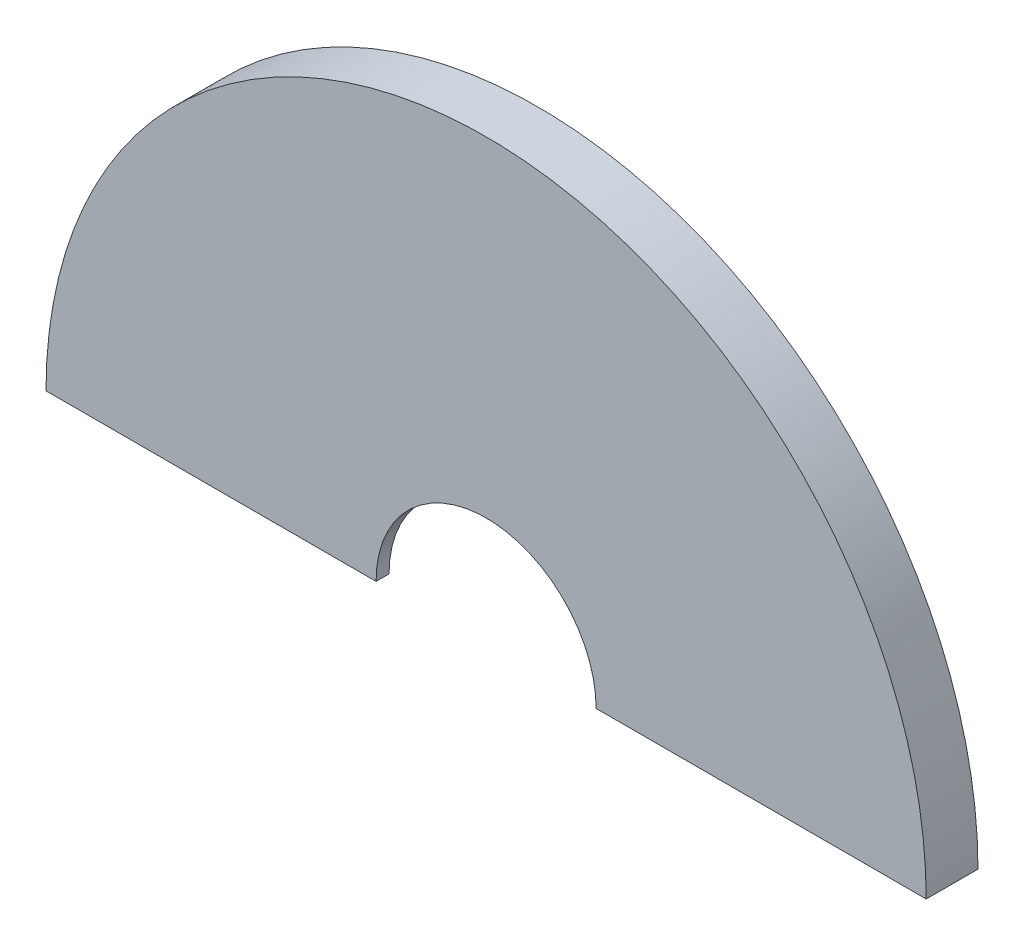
ISO-10303-21;
HEADER;
FILE_DESCRIPTION(('STEP AP214'),'2;1');
FILE_NAME('part.step','',(''),(''),'','','');
FILE_SCHEMA(('AUTOMOTIVE_DESIGN { 1 0 10303 214 1 1 1 1 }'));
ENDSEC;
DATA;
#1=APPLICATION_CONTEXT('core data for automotive mechanical design processes');
#2=APPLICATION_PROTOCOL_DEFINITION('international standard','automotive_design',2000,#1);
#3=PRODUCT_CONTEXT('',#1,'mechanical');
#4=PRODUCT('Part','Part','',(#3));
#5=PRODUCT_RELATED_PRODUCT_CATEGORY('part','',(#4));
#6=PRODUCT_DEFINITION_FORMATION('','',#4);
#7=PRODUCT_DEFINITION_CONTEXT('part definition',#1,'design');
#8=PRODUCT_DEFINITION('design','',#6,#7);
#9=PRODUCT_DEFINITION_SHAPE('','',#8);
#10=(LENGTH_UNIT() NAMED_UNIT(*) SI_UNIT(.MILLI.,.METRE.));
#11=(NAMED_UNIT(*) PLANE_ANGLE_UNIT() SI_UNIT($,.RADIAN.));
#12=(NAMED_UNIT(*) SI_UNIT($,.STERADIAN.) SOLID_ANGLE_UNIT());
#13=UNCERTAINTY_MEASURE_WITH_UNIT(LENGTH_MEASURE(1.E-05),#10,'distance_accuracy_value','');
#14=(GEOMETRIC_REPRESENTATION_CONTEXT(3) GLOBAL_UNCERTAINTY_ASSIGNED_CONTEXT((#13)) GLOBAL_UNIT_ASSIGNED_CONTEXT((#10,
#11,#12)) REPRESENTATION_CONTEXT('',''));
#15=CARTESIAN_POINT('',(0.,0.,0.));
#16=DIRECTION('',(0.,0.,1.));
#17=DIRECTION('',(1.,0.,0.));
#18=AXIS2_PLACEMENT_3D('',#15,#16,#17);
#19=CARTESIAN_POINT('',(0.,0.,-6.5));
#20=DIRECTION('',(0.,0.,1.));
#21=DIRECTION('',(1.,0.,0.));
#22=AXIS2_PLACEMENT_3D('',#19,#20,#21);
#23=CYLINDRICAL_SURFACE('',#22,15.5);
#24=CARTESIAN_POINT('',(0.,0.,-3.));
#25=DIRECTION('',(0.,0.,-1.));
#26=DIRECTION('',(-1.,0.,0.));
#27=AXIS2_PLACEMENT_3D('',#24,#25,#26);
#28=CIRCLE('',#27,15.5);
#29=CARTESIAN_POINT('',(15.5,0.,-3.));
#30=VERTEX_POINT('',#29);
#31=CARTESIAN_POINT('',(15.4883827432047,0.600000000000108,-3.));
#32=VERTEX_POINT('',#31);
#33=EDGE_CURVE('E356',#30,#32,#28,.F.);
#34=ORIENTED_EDGE('',*,*,#33,.F.);
#35=DIRECTION('',(0.,0.,1.));
#36=VECTOR('',#35,1.);
#37=CARTESIAN_POINT('',(15.5,0.,-6.5));
#38=LINE('',#37,#36);
#39=CARTESIAN_POINT('',(15.5,0.,-6.));
#40=VERTEX_POINT('',#39);
#41=EDGE_CURVE('E714',#30,#40,#38,.F.);
#42=ORIENTED_EDGE('',*,*,#41,.T.);
#43=CARTESIAN_POINT('',(0.,0.,-6.));
#44=DIRECTION('',(0.,0.,1.));
#45=DIRECTION('',(1.,0.,0.));
#46=AXIS2_PLACEMENT_3D('',#43,#44,#45);
#47=CIRCLE('',#46,15.5);
#48=CARTESIAN_POINT('',(-15.5,0.,-6.));
#49=VERTEX_POINT('',#48);
#50=EDGE_CURVE('E286',#40,#49,#47,.T.);
#51=ORIENTED_EDGE('',*,*,#50,.T.);
#52=DIRECTION('',(0.,0.,1.));
#53=VECTOR('',#52,1.);
#54=CARTESIAN_POINT('',(-15.5,0.,-6.5));
#55=LINE('',#54,#53);
#56=CARTESIAN_POINT('',(-15.5,0.,-3.));
#57=VERTEX_POINT('',#56);
#58=EDGE_CURVE('E48',#49,#57,#55,.T.);
#59=ORIENTED_EDGE('',*,*,#58,.T.);
#60=CARTESIAN_POINT('',(0.,0.,-3.));
#61=DIRECTION('',(0.,0.,-1.));
#62=DIRECTION('',(-1.,0.,0.));
#63=AXIS2_PLACEMENT_3D('',#60,#61,#62);
#64=CIRCLE('',#63,15.5);
#65=CARTESIAN_POINT('',(-15.4883827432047,0.6,-3.));
#66=VERTEX_POINT('',#65);
#67=EDGE_CURVE('E339',#66,#57,#64,.F.);
#68=ORIENTED_EDGE('',*,*,#67,.F.);
#69=DIRECTION('',(0.,0.,1.));
#70=VECTOR('',#69,1.);
#71=CARTESIAN_POINT('',(-15.4883827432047,0.6,-6.5));
#72=LINE('',#71,#70);
#73=CARTESIAN_POINT('',(-15.4883827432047,0.6,-1.));
#74=VERTEX_POINT('',#73);
#75=EDGE_CURVE('E336',#66,#74,#72,.T.);
#76=ORIENTED_EDGE('',*,*,#75,.T.);
#77=CARTESIAN_POINT('',(0.,0.,-1.));
#78=DIRECTION('',(0.,0.,1.));
#79=DIRECTION('',(1.,0.,0.));
#80=AXIS2_PLACEMENT_3D('',#77,#78,#79);
#81=CIRCLE('',#80,15.5);
#82=CARTESIAN_POINT('',(-13.7133329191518,7.22457612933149,-1.));
#83=VERTEX_POINT('',#82);
#84=EDGE_CURVE('E319',#83,#74,#81,.T.);
#85=ORIENTED_EDGE('',*,*,#84,.F.);
#86=DIRECTION('',(0.,0.,1.));
#87=VECTOR('',#86,1.);
#88=CARTESIAN_POINT('',(-13.7133329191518,7.22457612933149,-6.5));
#89=LINE('',#88,#87);
#90=CARTESIAN_POINT('',(-13.7133329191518,7.22457612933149,-3.));
#91=VERTEX_POINT('',#90);
#92=EDGE_CURVE('E477',#83,#91,#89,.F.);
#93=ORIENTED_EDGE('',*,*,#92,.T.);
#94=CARTESIAN_POINT('',(0.,0.,-3.));
#95=DIRECTION('',(0.,0.,-1.));
#96=DIRECTION('',(-1.,0.,0.));
#97=AXIS2_PLACEMENT_3D('',#94,#95,#96);
#98=CIRCLE('',#97,15.5);
#99=CARTESIAN_POINT('',(-13.1133329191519,8.26380661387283,-3.));
#100=VERTEX_POINT('',#99);
#101=EDGE_CURVE('E481',#100,#91,#98,.F.);
#102=ORIENTED_EDGE('',*,*,#101,.F.);
#103=DIRECTION('',(0.,0.,1.));
#104=VECTOR('',#103,1.);
#105=CARTESIAN_POINT('',(-13.1133329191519,8.26380661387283,-6.5));
#106=LINE('',#105,#104);
#107=CARTESIAN_POINT('',(-13.1133329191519,8.26380661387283,-1.));
#108=VERTEX_POINT('',#107);
#109=EDGE_CURVE('E479',#100,#108,#106,.T.);
#110=ORIENTED_EDGE('',*,*,#109,.T.);
#111=CARTESIAN_POINT('',(-8.26380661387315,13.1133329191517,-1.));
#112=VERTEX_POINT('',#111);
#113=EDGE_CURVE('E321',#112,#108,#81,.T.);
#114=ORIENTED_EDGE('',*,*,#113,.F.);
#115=DIRECTION('',(0.,0.,1.));
#116=VECTOR('',#115,1.);
#117=CARTESIAN_POINT('',(-8.26380661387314,13.1133329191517,-6.5));
#118=LINE('',#117,#116);
#119=CARTESIAN_POINT('',(-8.26380661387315,13.1133329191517,-3.));
#120=VERTEX_POINT('',#119);
#121=EDGE_CURVE('E449',#112,#120,#118,.F.);
#122=ORIENTED_EDGE('',*,*,#121,.T.);
#123=CARTESIAN_POINT('',(0.,0.,-3.));
#124=DIRECTION('',(0.,0.,-1.));
#125=DIRECTION('',(-1.,0.,0.));
#126=AXIS2_PLACEMENT_3D('',#123,#124,#125);
#127=CIRCLE('',#126,15.5);
#128=CARTESIAN_POINT('',(-7.22457612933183,13.7133329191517,-3.));
#129=VERTEX_POINT('',#128);
#130=EDGE_CURVE('E453',#129,#120,#127,.F.);
#131=ORIENTED_EDGE('',*,*,#130,.F.);
#132=DIRECTION('',(0.,0.,1.));
#133=VECTOR('',#132,1.);
#134=CARTESIAN_POINT('',(-7.22457612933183,13.7133329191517,-6.5));
#135=LINE('',#134,#133);
#136=CARTESIAN_POINT('',(-7.22457612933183,13.7133329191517,-1.));
#137=VERTEX_POINT('',#136);
#138=EDGE_CURVE('E451',#129,#137,#135,.T.);
#139=ORIENTED_EDGE('',*,*,#138,.T.);
#140=CARTESIAN_POINT('',(-0.600000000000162,15.4883827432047,-1.));
#141=VERTEX_POINT('',#140);
#142=EDGE_CURVE('E668',#141,#137,#81,.T.);
#143=ORIENTED_EDGE('',*,*,#142,.F.);
#144=DIRECTION('',(0.,0.,1.));
#145=VECTOR('',#144,1.);
#146=CARTESIAN_POINT('',(-0.600000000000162,15.4883827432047,-6.5));
#147=LINE('',#146,#145);
#148=CARTESIAN_POINT('',(-0.600000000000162,15.4883827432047,-3.));
#149=VERTEX_POINT('',#148);
#150=EDGE_CURVE('E423',#141,#149,#147,.F.);
#151=ORIENTED_EDGE('',*,*,#150,.T.);
#152=CARTESIAN_POINT('',(0.,0.,-3.));
#153=DIRECTION('',(0.,0.,-1.));
#154=DIRECTION('',(-1.,0.,0.));
#155=AXIS2_PLACEMENT_3D('',#152,#153,#154);
#156=CIRCLE('',#155,15.5);
#157=CARTESIAN_POINT('',(0.599999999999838,15.4883827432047,-3.));
#158=VERTEX_POINT('',#157);
#159=EDGE_CURVE('E428',#158,#149,#156,.F.);
#160=ORIENTED_EDGE('',*,*,#159,.F.);
#161=DIRECTION('',(0.,0.,1.));
#162=VECTOR('',#161,1.);
#163=CARTESIAN_POINT('',(0.599999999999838,15.4883827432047,-6.5));
#164=LINE('',#163,#162);
#165=CARTESIAN_POINT('',(0.599999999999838,15.4883827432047,-1.5));
#166=VERTEX_POINT('',#165);
#167=EDGE_CURVE('E425',#158,#166,#164,.T.);
#168=ORIENTED_EDGE('',*,*,#167,.T.);
#169=CARTESIAN_POINT('',(0.,0.,-1.5));
#170=DIRECTION('',(0.,0.,1.));
#171=DIRECTION('',(1.,0.,0.));
#172=AXIS2_PLACEMENT_3D('',#169,#170,#171);
#173=CIRCLE('',#172,15.5);
#174=CARTESIAN_POINT('',(7.22457612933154,13.7133329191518,-1.5));
#175=VERTEX_POINT('',#174);
#176=EDGE_CURVE('E296',#166,#175,#173,.F.);
#177=ORIENTED_EDGE('',*,*,#176,.T.);
#178=DIRECTION('',(0.,0.,1.));
#179=VECTOR('',#178,1.);
#180=CARTESIAN_POINT('',(7.22457612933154,13.7133329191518,-6.5));
#181=LINE('',#180,#179);
#182=CARTESIAN_POINT('',(7.22457612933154,13.7133329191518,-3.));
#183=VERTEX_POINT('',#182);
#184=EDGE_CURVE('E398',#175,#183,#181,.F.);
#185=ORIENTED_EDGE('',*,*,#184,.T.);
#186=CARTESIAN_POINT('',(0.,0.,-3.));
#187=DIRECTION('',(0.,0.,-1.));
#188=DIRECTION('',(-1.,0.,0.));
#189=AXIS2_PLACEMENT_3D('',#186,#187,#188);
#190=CIRCLE('',#189,15.5);
#191=CARTESIAN_POINT('',(8.26380661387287,13.1133329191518,-3.));
#192=VERTEX_POINT('',#191);
#193=EDGE_CURVE('E402',#192,#183,#190,.F.);
#194=ORIENTED_EDGE('',*,*,#193,.F.);
#195=DIRECTION('',(0.,0.,1.));
#196=VECTOR('',#195,1.);
#197=CARTESIAN_POINT('',(8.26380661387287,13.1133329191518,-6.5));
#198=LINE('',#197,#196);
#199=CARTESIAN_POINT('',(8.26380661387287,13.1133329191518,-1.));
#200=VERTEX_POINT('',#199);
#201=EDGE_CURVE('E400',#192,#200,#198,.T.);
#202=ORIENTED_EDGE('',*,*,#201,.T.);
#203=CARTESIAN_POINT('',(13.1133329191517,8.2638066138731,-1.));
#204=VERTEX_POINT('',#203);
#205=EDGE_CURVE('E665',#204,#200,#81,.T.);
#206=ORIENTED_EDGE('',*,*,#205,.F.);
#207=DIRECTION('',(0.,0.,1.));
#208=VECTOR('',#207,1.);
#209=CARTESIAN_POINT('',(13.1133329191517,8.2638066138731,-6.5));
#210=LINE('',#209,#208);
#211=CARTESIAN_POINT('',(13.1133329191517,8.2638066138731,-3.));
#212=VERTEX_POINT('',#211);
#213=EDGE_CURVE('E370',#204,#212,#210,.F.);
#214=ORIENTED_EDGE('',*,*,#213,.T.);
#215=CARTESIAN_POINT('',(0.,0.,-3.));
#216=DIRECTION('',(0.,0.,-1.));
#217=DIRECTION('',(-1.,0.,0.));
#218=AXIS2_PLACEMENT_3D('',#215,#216,#217);
#219=CIRCLE('',#218,15.5);
#220=CARTESIAN_POINT('',(13.7133329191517,7.22457612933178,-3.));
#221=VERTEX_POINT('',#220);
#222=EDGE_CURVE('E374',#221,#212,#219,.F.);
#223=ORIENTED_EDGE('',*,*,#222,.F.);
#224=DIRECTION('',(0.,0.,1.));
#225=VECTOR('',#224,1.);
#226=CARTESIAN_POINT('',(13.7133329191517,7.22457612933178,-6.5));
#227=LINE('',#226,#225);
#228=CARTESIAN_POINT('',(13.7133329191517,7.22457612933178,-1.));
#229=VERTEX_POINT('',#228);
#230=EDGE_CURVE('E372',#221,#229,#227,.T.);
#231=ORIENTED_EDGE('',*,*,#230,.T.);
#232=CARTESIAN_POINT('',(15.4883827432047,0.600000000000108,-1.));
#233=VERTEX_POINT('',#232);
#234=EDGE_CURVE('E318',#233,#229,#81,.T.);
#235=ORIENTED_EDGE('',*,*,#234,.F.);
#236=DIRECTION('',(0.,0.,1.));
#237=VECTOR('',#236,1.);
#238=CARTESIAN_POINT('',(15.4883827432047,0.600000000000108,-6.5));
#239=LINE('',#238,#237);
#240=EDGE_CURVE('E353',#233,#32,#239,.F.);
#241=ORIENTED_EDGE('',*,*,#240,.T.);
#242=EDGE_LOOP('',(#34,#42,#51,#59,#68,#76,#85,#93,#102,#110,#114,#122,#131,#139,#143,#151,#160,
#168,#177,#185,#194,#202,#206,#214,#223,#231,#235,#241));
#243=FACE_BOUND('',#242,.T.);
#244=ADVANCED_FACE('F33',(#243),#23,.T.);
#245=CARTESIAN_POINT('',(0.,0.,-4.));
#246=DIRECTION('',(0.,0.,1.));
#247=DIRECTION('',(1.,0.,0.));
#248=AXIS2_PLACEMENT_3D('',#245,#246,#247);
#249=CYLINDRICAL_SURFACE('',#248,33.);
#250=CARTESIAN_POINT('',(0.,0.,-4.));
#251=DIRECTION('',(0.,0.,-1.));
#252=DIRECTION('',(-1.,0.,0.));
#253=AXIS2_PLACEMENT_3D('',#250,#251,#252);
#254=CIRCLE('',#253,33.);
#255=CARTESIAN_POINT('',(-33.,0.,-4.));
#256=VERTEX_POINT('',#255);
#257=CARTESIAN_POINT('',(33.,0.,-4.));
#258=VERTEX_POINT('',#257);
#259=EDGE_CURVE('E328',#256,#258,#254,.T.);
#260=ORIENTED_EDGE('',*,*,#259,.T.);
#261=DIRECTION('',(0.,0.,1.));
#262=VECTOR('',#261,1.);
#263=CARTESIAN_POINT('',(33.,0.,-4.));
#264=LINE('',#263,#262);
#265=CARTESIAN_POINT('',(33.,0.,-3.));
#266=VERTEX_POINT('',#265);
#267=EDGE_CURVE('E725',#258,#266,#264,.T.);
#268=ORIENTED_EDGE('',*,*,#267,.T.);
#269=CARTESIAN_POINT('',(0.,0.,-3.));
#270=DIRECTION('',(0.,0.,-1.));
#271=DIRECTION('',(1.,0.,0.));
#272=AXIS2_PLACEMENT_3D('',#269,#270,#271);
#273=CIRCLE('',#272,33.);
#274=CARTESIAN_POINT('',(32.994545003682,0.60000000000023,-3.));
#275=VERTEX_POINT('',#274);
#276=EDGE_CURVE('E361',#275,#266,#273,.T.);
#277=ORIENTED_EDGE('',*,*,#276,.F.);
#278=DIRECTION('',(0.,0.,1.));
#279=VECTOR('',#278,1.);
#280=CARTESIAN_POINT('',(32.994545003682,0.60000000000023,-3.));
#281=LINE('',#280,#279);
#282=CARTESIAN_POINT('',(32.994545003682,0.60000000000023,-1.));
#283=VERTEX_POINT('',#282);
#284=EDGE_CURVE('E358',#275,#283,#281,.T.);
#285=ORIENTED_EDGE('',*,*,#284,.T.);
#286=CARTESIAN_POINT('',(0.,0.,-1.));
#287=DIRECTION('',(0.,0.,-1.));
#288=DIRECTION('',(-1.,0.,0.));
#289=AXIS2_PLACEMENT_3D('',#286,#287,#288);
#290=CIRCLE('',#289,33.);
#291=CARTESIAN_POINT('',(28.8741141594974,15.9776572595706,-1.));
#292=VERTEX_POINT('',#291);
#293=EDGE_CURVE('E335',#292,#283,#290,.T.);
#294=ORIENTED_EDGE('',*,*,#293,.F.);
#295=DIRECTION('',(0.,0.,1.));
#296=VECTOR('',#295,1.);
#297=CARTESIAN_POINT('',(28.8741141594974,15.9776572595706,-3.));
#298=LINE('',#297,#296);
#299=CARTESIAN_POINT('',(28.8741141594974,15.9776572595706,-3.));
#300=VERTEX_POINT('',#299);
#301=EDGE_CURVE('E380',#300,#292,#298,.T.);
#302=ORIENTED_EDGE('',*,*,#301,.F.);
#303=CARTESIAN_POINT('',(0.,0.,-3.));
#304=DIRECTION('',(0.,0.,-1.));
#305=DIRECTION('',(0.866025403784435,0.500000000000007,0.));
#306=AXIS2_PLACEMENT_3D('',#303,#304,#305);
#307=CIRCLE('',#306,33.);
#308=CARTESIAN_POINT('',(28.2741141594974,17.0168877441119,-3.));
#309=VERTEX_POINT('',#308);
#310=EDGE_CURVE('E386',#309,#300,#307,.T.);
#311=ORIENTED_EDGE('',*,*,#310,.F.);
#312=DIRECTION('',(0.,0.,1.));
#313=VECTOR('',#312,1.);
#314=CARTESIAN_POINT('',(28.2741141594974,17.0168877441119,-3.));
#315=LINE('',#314,#313);
#316=CARTESIAN_POINT('',(28.2741141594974,17.0168877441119,-1.));
#317=VERTEX_POINT('',#316);
#318=EDGE_CURVE('E377',#309,#317,#315,.T.);
#319=ORIENTED_EDGE('',*,*,#318,.T.);
#320=CARTESIAN_POINT('',(17.0168877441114,28.2741141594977,-1.));
#321=VERTEX_POINT('',#320);
#322=EDGE_CURVE('E657',#321,#317,#290,.T.);
#323=ORIENTED_EDGE('',*,*,#322,.F.);
#324=DIRECTION('',(0.,0.,1.));
#325=VECTOR('',#324,1.);
#326=CARTESIAN_POINT('',(17.0168877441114,28.2741141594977,-3.));
#327=LINE('',#326,#325);
#328=CARTESIAN_POINT('',(17.0168877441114,28.2741141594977,-3.));
#329=VERTEX_POINT('',#328);
#330=EDGE_CURVE('E409',#329,#321,#327,.T.);
#331=ORIENTED_EDGE('',*,*,#330,.F.);
#332=CARTESIAN_POINT('',(0.,0.,-3.));
#333=DIRECTION('',(0.,0.,-1.));
#334=DIRECTION('',(0.499999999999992,0.866025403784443,0.));
#335=AXIS2_PLACEMENT_3D('',#332,#333,#334);
#336=CIRCLE('',#335,33.);
#337=CARTESIAN_POINT('',(15.9776572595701,28.8741141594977,-3.));
#338=VERTEX_POINT('',#337);
#339=EDGE_CURVE('E414',#338,#329,#336,.T.);
#340=ORIENTED_EDGE('',*,*,#339,.F.);
#341=DIRECTION('',(0.,0.,1.));
#342=VECTOR('',#341,1.);
#343=CARTESIAN_POINT('',(15.9776572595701,28.8741141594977,-3.));
#344=LINE('',#343,#342);
#345=CARTESIAN_POINT('',(15.9776572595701,28.8741141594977,-1.5));
#346=VERTEX_POINT('',#345);
#347=EDGE_CURVE('E410',#338,#346,#344,.T.);
#348=ORIENTED_EDGE('',*,*,#347,.T.);
#349=CARTESIAN_POINT('',(0.,0.,-1.5));
#350=DIRECTION('',(0.,0.,1.));
#351=DIRECTION('',(1.,0.,0.));
#352=AXIS2_PLACEMENT_3D('',#349,#350,#351);
#353=CIRCLE('',#352,33.);
#354=CARTESIAN_POINT('',(0.599999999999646,32.9945450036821,-1.5));
#355=VERTEX_POINT('',#354);
#356=EDGE_CURVE('E292',#346,#355,#353,.T.);
#357=ORIENTED_EDGE('',*,*,#356,.T.);
#358=DIRECTION('',(0.,0.,1.));
#359=VECTOR('',#358,1.);
#360=CARTESIAN_POINT('',(0.599999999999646,32.9945450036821,-3.));
#361=LINE('',#360,#359);
#362=CARTESIAN_POINT('',(0.599999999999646,32.9945450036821,-3.));
#363=VERTEX_POINT('',#362);
#364=EDGE_CURVE('E434',#363,#355,#361,.T.);
#365=ORIENTED_EDGE('',*,*,#364,.F.);
#366=CARTESIAN_POINT('',(0.,0.,-3.));
#367=DIRECTION('',(0.,0.,-1.));
#368=DIRECTION('',(0.,1.,0.));
#369=AXIS2_PLACEMENT_3D('',#366,#367,#368);
#370=CIRCLE('',#369,33.);
#371=CARTESIAN_POINT('',(-0.600000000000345,32.994545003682,-3.));
#372=VERTEX_POINT('',#371);
#373=EDGE_CURVE('E440',#372,#363,#370,.T.);
#374=ORIENTED_EDGE('',*,*,#373,.F.);
#375=DIRECTION('',(0.,0.,1.));
#376=VECTOR('',#375,1.);
#377=CARTESIAN_POINT('',(-0.600000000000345,32.994545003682,-3.));
#378=LINE('',#377,#376);
#379=CARTESIAN_POINT('',(-0.600000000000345,32.994545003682,-1.));
#380=VERTEX_POINT('',#379);
#381=EDGE_CURVE('E431',#372,#380,#378,.T.);
#382=ORIENTED_EDGE('',*,*,#381,.T.);
#383=CARTESIAN_POINT('',(-15.9776572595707,28.8741141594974,-1.));
#384=VERTEX_POINT('',#383);
#385=EDGE_CURVE('E776',#384,#380,#290,.T.);
#386=ORIENTED_EDGE('',*,*,#385,.F.);
#387=DIRECTION('',(0.,0.,1.));
#388=VECTOR('',#387,1.);
#389=CARTESIAN_POINT('',(-15.9776572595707,28.8741141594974,-3.));
#390=LINE('',#389,#388);
#391=CARTESIAN_POINT('',(-15.9776572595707,28.8741141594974,-3.));
#392=VERTEX_POINT('',#391);
#393=EDGE_CURVE('E459',#392,#384,#390,.T.);
#394=ORIENTED_EDGE('',*,*,#393,.F.);
#395=CARTESIAN_POINT('',(0.,0.,-3.));
#396=DIRECTION('',(0.,0.,-1.));
#397=DIRECTION('',(-0.50000000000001,0.866025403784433,0.));
#398=AXIS2_PLACEMENT_3D('',#395,#396,#397);
#399=CIRCLE('',#398,33.);
#400=CARTESIAN_POINT('',(-17.016887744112,28.2741141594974,-3.));
#401=VERTEX_POINT('',#400);
#402=EDGE_CURVE('E465',#401,#392,#399,.T.);
#403=ORIENTED_EDGE('',*,*,#402,.F.);
#404=DIRECTION('',(0.,0.,1.));
#405=VECTOR('',#404,1.);
#406=CARTESIAN_POINT('',(-17.016887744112,28.2741141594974,-3.));
#407=LINE('',#406,#405);
#408=CARTESIAN_POINT('',(-17.016887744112,28.2741141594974,-1.));
#409=VERTEX_POINT('',#408);
#410=EDGE_CURVE('E456',#401,#409,#407,.T.);
#411=ORIENTED_EDGE('',*,*,#410,.T.);
#412=CARTESIAN_POINT('',(-28.2741141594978,17.0168877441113,-1.));
#413=VERTEX_POINT('',#412);
#414=EDGE_CURVE('E334',#413,#409,#290,.T.);
#415=ORIENTED_EDGE('',*,*,#414,.F.);
#416=DIRECTION('',(0.,0.,1.));
#417=VECTOR('',#416,1.);
#418=CARTESIAN_POINT('',(-28.2741141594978,17.0168877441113,-3.));
#419=LINE('',#418,#417);
#420=CARTESIAN_POINT('',(-28.2741141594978,17.0168877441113,-3.));
#421=VERTEX_POINT('',#420);
#422=EDGE_CURVE('E493',#421,#413,#419,.T.);
#423=ORIENTED_EDGE('',*,*,#422,.F.);
#424=CARTESIAN_POINT('',(0.,0.,-3.));
#425=DIRECTION('',(0.,0.,-1.));
#426=DIRECTION('',(-0.866025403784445,0.499999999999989,0.));
#427=AXIS2_PLACEMENT_3D('',#424,#425,#426);
#428=CIRCLE('',#427,33.);
#429=CARTESIAN_POINT('',(-28.8741141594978,15.97765725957,-3.));
#430=VERTEX_POINT('',#429);
#431=EDGE_CURVE('E497',#430,#421,#428,.T.);
#432=ORIENTED_EDGE('',*,*,#431,.F.);
#433=DIRECTION('',(0.,0.,1.));
#434=VECTOR('',#433,1.);
#435=CARTESIAN_POINT('',(-28.8741141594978,15.97765725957,-3.));
#436=LINE('',#435,#434);
#437=CARTESIAN_POINT('',(-28.8741141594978,15.97765725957,-1.));
#438=VERTEX_POINT('',#437);
#439=EDGE_CURVE('E488',#430,#438,#436,.T.);
#440=ORIENTED_EDGE('',*,*,#439,.T.);
#441=CARTESIAN_POINT('',(-32.994545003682,0.6,-1.));
#442=VERTEX_POINT('',#441);
#443=EDGE_CURVE('E331',#442,#438,#290,.T.);
#444=ORIENTED_EDGE('',*,*,#443,.F.);
#445=DIRECTION('',(0.,0.,1.));
#446=VECTOR('',#445,1.);
#447=CARTESIAN_POINT('',(-32.994545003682,0.599999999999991,-3.));
#448=LINE('',#447,#446);
#449=CARTESIAN_POINT('',(-32.994545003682,0.599999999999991,-3.));
#450=VERTEX_POINT('',#449);
#451=EDGE_CURVE('E342',#450,#442,#448,.T.);
#452=ORIENTED_EDGE('',*,*,#451,.F.);
#453=CARTESIAN_POINT('',(0.,0.,-3.));
#454=DIRECTION('',(0.,0.,-1.));
#455=DIRECTION('',(-1.,0.,0.));
#456=AXIS2_PLACEMENT_3D('',#453,#454,#455);
#457=CIRCLE('',#456,33.);
#458=CARTESIAN_POINT('',(-33.,0.,-3.));
#459=VERTEX_POINT('',#458);
#460=EDGE_CURVE('E348',#459,#450,#457,.T.);
#461=ORIENTED_EDGE('',*,*,#460,.F.);
#462=DIRECTION('',(0.,0.,1.));
#463=VECTOR('',#462,1.);
#464=CARTESIAN_POINT('',(-33.,0.,-4.));
#465=LINE('',#464,#463);
#466=EDGE_CURVE('E688',#459,#256,#465,.F.);
#467=ORIENTED_EDGE('',*,*,#466,.T.);
#468=EDGE_LOOP('',(#260,#268,#277,#285,#294,#302,#311,#319,#323,#331,#340,#348,#357,#365,#374,
#382,#386,#394,#403,#411,#415,#423,#432,#440,#444,#452,#461,#467));
#469=FACE_BOUND('',#468,.T.);
#470=ADVANCED_FACE('F607',(#469),#249,.F.);
#471=CARTESIAN_POINT('',(0.,0.,-1.));
#472=DIRECTION('',(0.,0.,1.));
#473=DIRECTION('',(1.,0.,0.));
#474=AXIS2_PLACEMENT_3D('',#471,#472,#473);
#475=PLANE('',#474);
#476=DIRECTION('',(1.,0.,0.));
#477=VECTOR('',#476,1.);
#478=CARTESIAN_POINT('',(0.,0.,-1.));
#479=LINE('',#478,#477);
#480=CARTESIAN_POINT('',(-13.,0.,-1.));
#481=VERTEX_POINT('',#480);
#482=CARTESIAN_POINT('',(-8.5,0.,-1.));
#483=VERTEX_POINT('',#482);
#484=EDGE_CURVE('E696',#481,#483,#479,.T.);
#485=ORIENTED_EDGE('',*,*,#484,.F.);
#486=CARTESIAN_POINT('',(0.,0.,-1.));
#487=DIRECTION('',(0.,0.,1.));
#488=DIRECTION('',(1.,0.,0.));
#489=AXIS2_PLACEMENT_3D('',#486,#487,#488);
#490=CIRCLE('',#489,13.);
#491=CARTESIAN_POINT('',(13.,0.,-1.));
#492=VERTEX_POINT('',#491);
#493=EDGE_CURVE('E308',#492,#481,#490,.T.);
#494=ORIENTED_EDGE('',*,*,#493,.F.);
#495=CARTESIAN_POINT('',(8.5,0.,-1.));
#496=VERTEX_POINT('',#495);
#497=EDGE_CURVE('E713',#496,#492,#479,.T.);
#498=ORIENTED_EDGE('',*,*,#497,.F.);
#499=CARTESIAN_POINT('',(0.,0.,-1.));
#500=DIRECTION('',(0.,0.,1.));
#501=DIRECTION('',(1.,0.,0.));
#502=AXIS2_PLACEMENT_3D('',#499,#500,#501);
#503=CIRCLE('',#502,8.5);
#504=EDGE_CURVE('E312',#496,#483,#503,.T.);
#505=ORIENTED_EDGE('',*,*,#504,.T.);
#506=EDGE_LOOP('',(#485,#494,#498,#505));
#507=FACE_BOUND('',#506,.T.);
#508=ADVANCED_FACE('F610',(#507),#475,.F.);
#509=CARTESIAN_POINT('',(0.,0.,-1.));
#510=DIRECTION('',(0.,0.,1.));
#511=DIRECTION('',(1.,0.,0.));
#512=AXIS2_PLACEMENT_3D('',#509,#510,#511);
#513=CYLINDRICAL_SURFACE('',#512,34.);
#514=CARTESIAN_POINT('',(0.,0.,0.));
#515=DIRECTION('',(0.,0.,1.));
#516=DIRECTION('',(1.,0.,0.));
#517=AXIS2_PLACEMENT_3D('',#514,#515,#516);
#518=CIRCLE('',#517,34.);
#519=CARTESIAN_POINT('',(34.,0.,0.));
#520=VERTEX_POINT('',#519);
#521=CARTESIAN_POINT('',(-34.,0.,0.));
#522=VERTEX_POINT('',#521);
#523=EDGE_CURVE('E309',#520,#522,#518,.T.);
#524=ORIENTED_EDGE('',*,*,#523,.F.);
#525=DIRECTION('',(0.,0.,1.));
#526=VECTOR('',#525,1.);
#527=CARTESIAN_POINT('',(34.,0.,-1.));
#528=LINE('',#527,#526);
#529=CARTESIAN_POINT('',(34.,0.,-4.));
#530=VERTEX_POINT('',#529);
#531=EDGE_CURVE('E722',#520,#530,#528,.F.);
#532=ORIENTED_EDGE('',*,*,#531,.T.);
#533=CARTESIAN_POINT('',(0.,0.,-4.));
#534=DIRECTION('',(0.,0.,-1.));
#535=DIRECTION('',(-1.,0.,0.));
#536=AXIS2_PLACEMENT_3D('',#533,#534,#535);
#537=CIRCLE('',#536,34.);
#538=CARTESIAN_POINT('',(-34.,0.,-4.));
#539=VERTEX_POINT('',#538);
#540=EDGE_CURVE('E325',#539,#530,#537,.T.);
#541=ORIENTED_EDGE('',*,*,#540,.F.);
#542=DIRECTION('',(0.,0.,1.));
#543=VECTOR('',#542,1.);
#544=CARTESIAN_POINT('',(-34.,0.,-1.));
#545=LINE('',#544,#543);
#546=EDGE_CURVE('E702',#539,#522,#545,.T.);
#547=ORIENTED_EDGE('',*,*,#546,.T.);
#548=EDGE_LOOP('',(#524,#532,#541,#547));
#549=FACE_BOUND('',#548,.T.);
#550=ADVANCED_FACE('F35',(#549),#513,.T.);
#551=CARTESIAN_POINT('',(0.,0.,0.));
#552=DIRECTION('',(0.,0.,1.));
#553=DIRECTION('',(1.,0.,0.));
#554=AXIS2_PLACEMENT_3D('',#551,#552,#553);
#555=PLANE('',#554);
#556=ORIENTED_EDGE('',*,*,#523,.T.);
#557=DIRECTION('',(1.,0.,0.));
#558=VECTOR('',#557,1.);
#559=CARTESIAN_POINT('',(0.,0.,0.));
#560=LINE('',#559,#558);
#561=CARTESIAN_POINT('',(-8.5,0.,0.));
#562=VERTEX_POINT('',#561);
#563=EDGE_CURVE('E694',#522,#562,#560,.T.);
#564=ORIENTED_EDGE('',*,*,#563,.T.);
#565=CARTESIAN_POINT('',(0.,0.,0.));
#566=DIRECTION('',(0.,0.,1.));
#567=DIRECTION('',(1.,0.,0.));
#568=AXIS2_PLACEMENT_3D('',#565,#566,#567);
#569=CIRCLE('',#568,8.5);
#570=CARTESIAN_POINT('',(8.5,0.,0.));
#571=VERTEX_POINT('',#570);
#572=EDGE_CURVE('E315',#571,#562,#569,.T.);
#573=ORIENTED_EDGE('',*,*,#572,.F.);
#574=EDGE_CURVE('E703',#571,#520,#560,.T.);
#575=ORIENTED_EDGE('',*,*,#574,.T.);
#576=EDGE_LOOP('',(#556,#564,#573,#575));
#577=FACE_BOUND('',#576,.T.);
#578=ADVANCED_FACE('F627',(#577),#555,.T.);
#579=CARTESIAN_POINT('',(0.,0.,-1.));
#580=DIRECTION('',(0.,0.,1.));
#581=DIRECTION('',(1.,0.,0.));
#582=AXIS2_PLACEMENT_3D('',#579,#580,#581);
#583=CYLINDRICAL_SURFACE('',#582,8.5);
#584=DIRECTION('',(0.,0.,1.));
#585=VECTOR('',#584,1.);
#586=CARTESIAN_POINT('',(8.5,0.,-1.));
#587=LINE('',#586,#585);
#588=EDGE_CURVE('E720',#571,#496,#587,.F.);
#589=ORIENTED_EDGE('',*,*,#588,.F.);
#590=ORIENTED_EDGE('',*,*,#572,.T.);
#591=DIRECTION('',(0.,0.,1.));
#592=VECTOR('',#591,1.);
#593=CARTESIAN_POINT('',(-8.5,0.,-1.));
#594=LINE('',#593,#592);
#595=EDGE_CURVE('E692',#483,#562,#594,.T.);
#596=ORIENTED_EDGE('',*,*,#595,.F.);
#597=ORIENTED_EDGE('',*,*,#504,.F.);
#598=EDGE_LOOP('',(#589,#590,#596,#597));
#599=FACE_BOUND('',#598,.T.);
#600=ADVANCED_FACE('F618',(#599),#583,.F.);
#601=CARTESIAN_POINT('',(0.,0.,-6.5));
#602=DIRECTION('',(0.,0.,1.));
#603=DIRECTION('',(1.,0.,0.));
#604=AXIS2_PLACEMENT_3D('',#601,#602,#603);
#605=CYLINDRICAL_SURFACE('',#604,13.);
#606=DIRECTION('',(0.,0.,1.));
#607=VECTOR('',#606,1.);
#608=CARTESIAN_POINT('',(13.,0.,-6.5));
#609=LINE('',#608,#607);
#610=CARTESIAN_POINT('',(13.,0.,-6.5));
#611=VERTEX_POINT('',#610);
#612=EDGE_CURVE('E711',#492,#611,#609,.F.);
#613=ORIENTED_EDGE('',*,*,#612,.F.);
#614=ORIENTED_EDGE('',*,*,#493,.T.);
#615=DIRECTION('',(0.,0.,1.));
#616=VECTOR('',#615,1.);
#617=CARTESIAN_POINT('',(-13.,0.,-6.5));
#618=LINE('',#617,#616);
#619=CARTESIAN_POINT('',(-13.,0.,-6.5));
#620=VERTEX_POINT('',#619);
#621=EDGE_CURVE('E283',#620,#481,#618,.T.);
#622=ORIENTED_EDGE('',*,*,#621,.F.);
#623=CARTESIAN_POINT('',(0.,0.,-6.5));
#624=DIRECTION('',(0.,0.,1.));
#625=DIRECTION('',(1.,0.,0.));
#626=AXIS2_PLACEMENT_3D('',#623,#624,#625);
#627=CIRCLE('',#626,13.);
#628=EDGE_CURVE('E282',#611,#620,#627,.T.);
#629=ORIENTED_EDGE('',*,*,#628,.F.);
#630=EDGE_LOOP('',(#613,#614,#622,#629));
#631=FACE_BOUND('',#630,.T.);
#632=ADVANCED_FACE('F615',(#631),#605,.F.);
#633=CARTESIAN_POINT('',(0.,0.,-6.5));
#634=DIRECTION('',(0.,0.,1.));
#635=DIRECTION('',(1.,0.,0.));
#636=AXIS2_PLACEMENT_3D('',#633,#634,#635);
#637=PLANE('',#636);
#638=DIRECTION('',(1.,0.,0.));
#639=VECTOR('',#638,1.);
#640=CARTESIAN_POINT('',(0.,0.,-6.5));
#641=LINE('',#640,#639);
#642=CARTESIAN_POINT('',(-15.,0.,-6.5));
#643=VERTEX_POINT('',#642);
#644=EDGE_CURVE('E270',#643,#620,#641,.T.);
#645=ORIENTED_EDGE('',*,*,#644,.F.);
#646=CARTESIAN_POINT('',(0.,0.,-6.5));
#647=DIRECTION('',(0.,0.,1.));
#648=DIRECTION('',(1.,0.,0.));
#649=AXIS2_PLACEMENT_3D('',#646,#647,#648);
#650=CIRCLE('',#649,15.);
#651=CARTESIAN_POINT('',(15.,0.,-6.5));
#652=VERTEX_POINT('',#651);
#653=EDGE_CURVE('E276',#643,#652,#650,.F.);
#654=ORIENTED_EDGE('',*,*,#653,.T.);
#655=EDGE_CURVE('E56',#611,#652,#641,.T.);
#656=ORIENTED_EDGE('',*,*,#655,.F.);
#657=ORIENTED_EDGE('',*,*,#628,.T.);
#658=EDGE_LOOP('',(#645,#654,#656,#657));
#659=FACE_BOUND('',#658,.T.);
#660=ADVANCED_FACE('F280',(#659),#637,.F.);
#661=CARTESIAN_POINT('',(0.,0.,-4.));
#662=DIRECTION('',(0.,0.,-1.));
#663=DIRECTION('',(-1.,0.,0.));
#664=AXIS2_PLACEMENT_3D('',#661,#662,#663);
#665=PLANE('',#664);
#666=ORIENTED_EDGE('',*,*,#540,.T.);
#667=DIRECTION('',(-1.,0.,0.));
#668=VECTOR('',#667,1.);
#669=CARTESIAN_POINT('',(0.,0.,-4.));
#670=LINE('',#669,#668);
#671=EDGE_CURVE('E710',#530,#258,#670,.T.);
#672=ORIENTED_EDGE('',*,*,#671,.T.);
#673=ORIENTED_EDGE('',*,*,#259,.F.);
#674=EDGE_CURVE('E707',#256,#539,#670,.T.);
#675=ORIENTED_EDGE('',*,*,#674,.T.);
#676=EDGE_LOOP('',(#666,#672,#673,#675));
#677=FACE_BOUND('',#676,.T.);
#678=ADVANCED_FACE('F601',(#677),#665,.T.);
#679=CARTESIAN_POINT('',(0.,0.,-3.));
#680=DIRECTION('',(0.,0.,-1.));
#681=DIRECTION('',(-1.,0.,0.));
#682=AXIS2_PLACEMENT_3D('',#679,#680,#681);
#683=PLANE('',#682);
#684=ORIENTED_EDGE('',*,*,#67,.T.);
#685=DIRECTION('',(-1.,0.,0.));
#686=VECTOR('',#685,1.);
#687=CARTESIAN_POINT('',(0.,0.,-3.));
#688=LINE('',#687,#686);
#689=EDGE_CURVE('E691',#57,#459,#688,.T.);
#690=ORIENTED_EDGE('',*,*,#689,.T.);
#691=ORIENTED_EDGE('',*,*,#460,.T.);
#692=DIRECTION('',(1.,0.,0.));
#693=VECTOR('',#692,1.);
#694=CARTESIAN_POINT('',(-12.9861464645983,0.6,-3.));
#695=LINE('',#694,#693);
#696=EDGE_CURVE('E345',#450,#66,#695,.T.);
#697=ORIENTED_EDGE('',*,*,#696,.T.);
#698=EDGE_LOOP('',(#684,#690,#691,#697));
#699=FACE_BOUND('',#698,.T.);
#700=ADVANCED_FACE('F593',(#699),#683,.T.);
#701=CARTESIAN_POINT('',(0.,0.,-3.));
#702=DIRECTION('',(0.,0.,-1.));
#703=DIRECTION('',(1.,0.,0.));
#704=AXIS2_PLACEMENT_3D('',#701,#702,#703);
#705=PLANE('',#704);
#706=ORIENTED_EDGE('',*,*,#276,.T.);
#707=DIRECTION('',(-1.,0.,0.));
#708=VECTOR('',#707,1.);
#709=CARTESIAN_POINT('',(0.,0.,-3.));
#710=LINE('',#709,#708);
#711=EDGE_CURVE('E717',#266,#30,#710,.T.);
#712=ORIENTED_EDGE('',*,*,#711,.T.);
#713=ORIENTED_EDGE('',*,*,#33,.T.);
#714=DIRECTION('',(1.,0.,0.));
#715=VECTOR('',#714,1.);
#716=CARTESIAN_POINT('',(12.9861464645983,0.60000000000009,-3.));
#717=LINE('',#716,#715);
#718=EDGE_CURVE('E364',#32,#275,#717,.T.);
#719=ORIENTED_EDGE('',*,*,#718,.T.);
#720=EDGE_LOOP('',(#706,#712,#713,#719));
#721=FACE_BOUND('',#720,.T.);
#722=ADVANCED_FACE('F590',(#721),#705,.T.);
#723=CARTESIAN_POINT('',(0.,0.,-6.));
#724=DIRECTION('',(0.,0.,1.));
#725=DIRECTION('',(1.,0.,0.));
#726=AXIS2_PLACEMENT_3D('',#723,#724,#725);
#727=TOROIDAL_SURFACE('',#726,15.,0.5);
#728=ORIENTED_EDGE('',*,*,#50,.F.);
#729=CARTESIAN_POINT('',(15.,0.,-6.));
#730=DIRECTION('',(0.,-1.,0.));
#731=DIRECTION('',(0.,0.,-1.));
#732=AXIS2_PLACEMENT_3D('',#729,#730,#731);
#733=CIRCLE('',#732,0.5);
#734=EDGE_CURVE('E11',#40,#652,#733,.F.);
#735=ORIENTED_EDGE('',*,*,#734,.T.);
#736=ORIENTED_EDGE('',*,*,#653,.F.);
#737=CARTESIAN_POINT('',(-15.,0.,-6.));
#738=DIRECTION('',(0.,-1.,0.));
#739=DIRECTION('',(0.,0.,-1.));
#740=AXIS2_PLACEMENT_3D('',#737,#738,#739);
#741=CIRCLE('',#740,0.5);
#742=EDGE_CURVE('E41',#643,#49,#741,.F.);
#743=ORIENTED_EDGE('',*,*,#742,.T.);
#744=EDGE_LOOP('',(#728,#735,#736,#743));
#745=FACE_BOUND('',#744,.T.);
#746=ADVANCED_FACE('F285',(#745),#727,.T.);
#747=DIRECTION('',(-0.866025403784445,0.499999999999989,0.));
#748=VECTOR('',#747,1.);
#749=CARTESIAN_POINT('',(-11.5463327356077,5.97345799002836,-1.));
#750=LINE('',#749,#748);
#751=EDGE_CURVE('E485',#83,#438,#750,.T.);
#752=ORIENTED_EDGE('',*,*,#751,.F.);
#753=ORIENTED_EDGE('',*,*,#84,.T.);
#754=DIRECTION('',(1.,0.,0.));
#755=VECTOR('',#754,1.);
#756=CARTESIAN_POINT('',(-12.9861464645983,0.6,-1.));
#757=LINE('',#756,#755);
#758=EDGE_CURVE('E350',#442,#74,#757,.T.);
#759=ORIENTED_EDGE('',*,*,#758,.F.);
#760=ORIENTED_EDGE('',*,*,#443,.T.);
#761=EDGE_LOOP('',(#752,#753,#759,#760));
#762=FACE_BOUND('',#761,.T.);
#763=ADVANCED_FACE('F631',(#762),#475,.F.);
#764=DIRECTION('',(0.866025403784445,-0.499999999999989,0.));
#765=VECTOR('',#764,1.);
#766=CARTESIAN_POINT('',(-10.9463327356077,7.01268847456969,-1.));
#767=LINE('',#766,#765);
#768=EDGE_CURVE('E490',#413,#108,#767,.T.);
#769=ORIENTED_EDGE('',*,*,#768,.F.);
#770=ORIENTED_EDGE('',*,*,#414,.T.);
#771=DIRECTION('',(-0.50000000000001,0.866025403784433,0.));
#772=VECTOR('',#771,1.);
#773=CARTESIAN_POINT('',(-7.01268847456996,10.9463327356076,-1.));
#774=LINE('',#773,#772);
#775=EDGE_CURVE('E474',#112,#409,#774,.T.);
#776=ORIENTED_EDGE('',*,*,#775,.F.);
#777=ORIENTED_EDGE('',*,*,#113,.T.);
#778=EDGE_LOOP('',(#769,#770,#776,#777));
#779=FACE_BOUND('',#778,.T.);
#780=ADVANCED_FACE('F633',(#779),#475,.F.);
#781=DIRECTION('',(0.50000000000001,-0.866025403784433,0.));
#782=VECTOR('',#781,1.);
#783=CARTESIAN_POINT('',(-5.97345799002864,11.5463327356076,-1.));
#784=LINE('',#783,#782);
#785=EDGE_CURVE('E471',#384,#137,#784,.T.);
#786=ORIENTED_EDGE('',*,*,#785,.F.);
#787=ORIENTED_EDGE('',*,*,#385,.T.);
#788=DIRECTION('',(0.,1.,0.));
#789=VECTOR('',#788,1.);
#790=CARTESIAN_POINT('',(-0.600000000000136,12.9861464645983,-1.));
#791=LINE('',#790,#789);
#792=EDGE_CURVE('E446',#141,#380,#791,.T.);
#793=ORIENTED_EDGE('',*,*,#792,.F.);
#794=ORIENTED_EDGE('',*,*,#142,.T.);
#795=EDGE_LOOP('',(#786,#787,#793,#794));
#796=FACE_BOUND('',#795,.T.);
#797=ADVANCED_FACE('F639',(#796),#475,.F.);
#798=DIRECTION('',(0.499999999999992,0.866025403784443,0.));
#799=VECTOR('',#798,1.);
#800=CARTESIAN_POINT('',(6.79156342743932,13.9633329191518,-1.));
#801=LINE('',#800,#799);
#802=CARTESIAN_POINT('',(15.2880616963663,28.6796996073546,-1.));
#803=VERTEX_POINT('',#802);
#804=CARTESIAN_POINT('',(7.0284434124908,14.3736210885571,-1.));
#805=VERTEX_POINT('',#804);
#806=EDGE_CURVE('E302',#803,#805,#801,.F.);
#807=ORIENTED_EDGE('',*,*,#806,.T.);
#808=CARTESIAN_POINT('',(0.,0.,-1.));
#809=DIRECTION('',(0.,0.,1.));
#810=DIRECTION('',(1.,0.,0.));
#811=AXIS2_PLACEMENT_3D('',#808,#809,#810);
#812=CIRCLE('',#811,16.);
#813=CARTESIAN_POINT('',(1.09999999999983,15.9621427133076,-1.));
#814=VERTEX_POINT('',#813);
#815=EDGE_CURVE('E299',#805,#814,#812,.T.);
#816=ORIENTED_EDGE('',*,*,#815,.T.);
#817=DIRECTION('',(0.,-1.,0.));
#818=VECTOR('',#817,1.);
#819=CARTESIAN_POINT('',(1.09999999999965,32.9945450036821,-1.));
#820=LINE('',#819,#818);
#821=CARTESIAN_POINT('',(1.09999999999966,32.4813792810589,-1.));
#822=VERTEX_POINT('',#821);
#823=EDGE_CURVE('E306',#814,#822,#820,.F.);
#824=ORIENTED_EDGE('',*,*,#823,.T.);
#825=CARTESIAN_POINT('',(0.,0.,-1.));
#826=DIRECTION('',(0.,0.,1.));
#827=DIRECTION('',(1.,0.,0.));
#828=AXIS2_PLACEMENT_3D('',#825,#826,#827);
#829=CIRCLE('',#828,32.5);
#830=EDGE_CURVE('E304',#822,#803,#829,.F.);
#831=ORIENTED_EDGE('',*,*,#830,.T.);
#832=EDGE_LOOP('',(#807,#816,#824,#831));
#833=FACE_BOUND('',#832,.T.);
#834=ADVANCED_FACE('F650',(#833),#475,.F.);
#835=DIRECTION('',(-0.499999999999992,-0.866025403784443,0.));
#836=VECTOR('',#835,1.);
#837=CARTESIAN_POINT('',(7.01268847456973,10.9463327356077,-1.));
#838=LINE('',#837,#836);
#839=EDGE_CURVE('E406',#321,#200,#838,.T.);
#840=ORIENTED_EDGE('',*,*,#839,.F.);
#841=ORIENTED_EDGE('',*,*,#322,.T.);
#842=DIRECTION('',(0.866025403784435,0.500000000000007,0.));
#843=VECTOR('',#842,1.);
#844=CARTESIAN_POINT('',(10.9463327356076,7.01268847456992,-1.));
#845=LINE('',#844,#843);
#846=EDGE_CURVE('E395',#204,#317,#845,.T.);
#847=ORIENTED_EDGE('',*,*,#846,.F.);
#848=ORIENTED_EDGE('',*,*,#205,.T.);
#849=EDGE_LOOP('',(#840,#841,#847,#848));
#850=FACE_BOUND('',#849,.T.);
#851=ADVANCED_FACE('F645',(#850),#475,.F.);
#852=DIRECTION('',(-0.866025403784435,-0.500000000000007,0.));
#853=VECTOR('',#852,1.);
#854=CARTESIAN_POINT('',(11.5463327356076,5.9734579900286,-1.));
#855=LINE('',#854,#853);
#856=EDGE_CURVE('E392',#292,#229,#855,.T.);
#857=ORIENTED_EDGE('',*,*,#856,.F.);
#858=ORIENTED_EDGE('',*,*,#293,.T.);
#859=DIRECTION('',(1.,0.,0.));
#860=VECTOR('',#859,1.);
#861=CARTESIAN_POINT('',(12.9861464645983,0.60000000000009,-1.));
#862=LINE('',#861,#860);
#863=EDGE_CURVE('E367',#233,#283,#862,.T.);
#864=ORIENTED_EDGE('',*,*,#863,.F.);
#865=ORIENTED_EDGE('',*,*,#234,.T.);
#866=EDGE_LOOP('',(#857,#858,#864,#865));
#867=FACE_BOUND('',#866,.T.);
#868=ADVANCED_FACE('F605',(#867),#475,.F.);
#869=CARTESIAN_POINT('',(-12.9861464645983,0.6,-3.));
#870=DIRECTION('',(0.,-1.,0.));
#871=DIRECTION('',(0.,0.,-1.));
#872=AXIS2_PLACEMENT_3D('',#869,#870,#871);
#873=PLANE('',#872);
#874=ORIENTED_EDGE('',*,*,#75,.F.);
#875=ORIENTED_EDGE('',*,*,#696,.F.);
#876=ORIENTED_EDGE('',*,*,#451,.T.);
#877=ORIENTED_EDGE('',*,*,#758,.T.);
#878=EDGE_LOOP('',(#874,#875,#876,#877));
#879=FACE_BOUND('',#878,.T.);
#880=ADVANCED_FACE('F597',(#879),#873,.F.);
#881=CARTESIAN_POINT('',(12.9861464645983,0.60000000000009,-3.));
#882=DIRECTION('',(0.,-1.,0.));
#883=DIRECTION('',(1.,0.,0.));
#884=AXIS2_PLACEMENT_3D('',#881,#882,#883);
#885=PLANE('',#884);
#886=ORIENTED_EDGE('',*,*,#240,.F.);
#887=ORIENTED_EDGE('',*,*,#863,.T.);
#888=ORIENTED_EDGE('',*,*,#284,.F.);
#889=ORIENTED_EDGE('',*,*,#718,.F.);
#890=EDGE_LOOP('',(#886,#887,#888,#889));
#891=FACE_BOUND('',#890,.T.);
#892=ADVANCED_FACE('F588',(#891),#885,.F.);
#893=CARTESIAN_POINT('',(10.9463327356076,7.01268847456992,-3.));
#894=DIRECTION('',(0.500000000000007,-0.866025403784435,0.));
#895=DIRECTION('',(0.866025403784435,0.500000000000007,0.));
#896=AXIS2_PLACEMENT_3D('',#893,#894,#895);
#897=PLANE('',#896);
#898=ORIENTED_EDGE('',*,*,#213,.F.);
#899=ORIENTED_EDGE('',*,*,#846,.T.);
#900=ORIENTED_EDGE('',*,*,#318,.F.);
#901=DIRECTION('',(0.866025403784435,0.500000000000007,0.));
#902=VECTOR('',#901,1.);
#903=CARTESIAN_POINT('',(10.9463327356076,7.01268847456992,-3.));
#904=LINE('',#903,#902);
#905=EDGE_CURVE('E389',#212,#309,#904,.T.);
#906=ORIENTED_EDGE('',*,*,#905,.F.);
#907=EDGE_LOOP('',(#898,#899,#900,#906));
#908=FACE_BOUND('',#907,.T.);
#909=ADVANCED_FACE('F584',(#908),#897,.F.);
#910=CARTESIAN_POINT('',(11.5463327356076,5.9734579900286,-3.));
#911=DIRECTION('',(-0.500000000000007,0.866025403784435,0.));
#912=DIRECTION('',(-0.866025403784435,-0.500000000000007,0.));
#913=AXIS2_PLACEMENT_3D('',#910,#911,#912);
#914=PLANE('',#913);
#915=ORIENTED_EDGE('',*,*,#230,.F.);
#916=DIRECTION('',(-0.866025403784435,-0.500000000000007,0.));
#917=VECTOR('',#916,1.);
#918=CARTESIAN_POINT('',(11.5463327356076,5.9734579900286,-3.));
#919=LINE('',#918,#917);
#920=EDGE_CURVE('E383',#300,#221,#919,.T.);
#921=ORIENTED_EDGE('',*,*,#920,.F.);
#922=ORIENTED_EDGE('',*,*,#301,.T.);
#923=ORIENTED_EDGE('',*,*,#856,.T.);
#924=EDGE_LOOP('',(#915,#921,#922,#923));
#925=FACE_BOUND('',#924,.T.);
#926=ADVANCED_FACE('F580',(#925),#914,.F.);
#927=CARTESIAN_POINT('',(0.,0.,-3.));
#928=DIRECTION('',(0.,0.,-1.));
#929=DIRECTION('',(0.866025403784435,0.500000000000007,0.));
#930=AXIS2_PLACEMENT_3D('',#927,#928,#929);
#931=PLANE('',#930);
#932=ORIENTED_EDGE('',*,*,#920,.T.);
#933=ORIENTED_EDGE('',*,*,#222,.T.);
#934=ORIENTED_EDGE('',*,*,#905,.T.);
#935=ORIENTED_EDGE('',*,*,#310,.T.);
#936=EDGE_LOOP('',(#932,#933,#934,#935));
#937=FACE_BOUND('',#936,.T.);
#938=ADVANCED_FACE('F570',(#937),#931,.T.);
#939=CARTESIAN_POINT('',(5.9734579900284,11.5463327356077,-3.));
#940=DIRECTION('',(0.866025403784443,-0.499999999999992,0.));
#941=DIRECTION('',(0.499999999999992,0.866025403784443,0.));
#942=AXIS2_PLACEMENT_3D('',#939,#940,#941);
#943=PLANE('',#942);
#944=ORIENTED_EDGE('',*,*,#184,.F.);
#945=DIRECTION('',(0.499999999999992,0.866025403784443,0.));
#946=VECTOR('',#945,1.);
#947=CARTESIAN_POINT('',(15.9776572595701,28.8741141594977,-1.5));
#948=LINE('',#947,#946);
#949=EDGE_CURVE('E294',#175,#346,#948,.T.);
#950=ORIENTED_EDGE('',*,*,#949,.T.);
#951=ORIENTED_EDGE('',*,*,#347,.F.);
#952=DIRECTION('',(0.499999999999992,0.866025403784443,0.));
#953=VECTOR('',#952,1.);
#954=CARTESIAN_POINT('',(5.9734579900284,11.5463327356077,-3.));
#955=LINE('',#954,#953);
#956=EDGE_CURVE('E411',#183,#338,#955,.T.);
#957=ORIENTED_EDGE('',*,*,#956,.F.);
#958=EDGE_LOOP('',(#944,#950,#951,#957));
#959=FACE_BOUND('',#958,.T.);
#960=ADVANCED_FACE('F566',(#959),#943,.F.);
#961=CARTESIAN_POINT('',(7.01268847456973,10.9463327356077,-3.));
#962=DIRECTION('',(-0.866025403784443,0.499999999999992,0.));
#963=DIRECTION('',(-0.499999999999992,-0.866025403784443,0.));
#964=AXIS2_PLACEMENT_3D('',#961,#962,#963);
#965=PLANE('',#964);
#966=ORIENTED_EDGE('',*,*,#201,.F.);
#967=DIRECTION('',(-0.499999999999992,-0.866025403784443,0.));
#968=VECTOR('',#967,1.);
#969=CARTESIAN_POINT('',(7.01268847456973,10.9463327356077,-3.));
#970=LINE('',#969,#968);
#971=EDGE_CURVE('E405',#329,#192,#970,.T.);
#972=ORIENTED_EDGE('',*,*,#971,.F.);
#973=ORIENTED_EDGE('',*,*,#330,.T.);
#974=ORIENTED_EDGE('',*,*,#839,.T.);
#975=EDGE_LOOP('',(#966,#972,#973,#974));
#976=FACE_BOUND('',#975,.T.);
#977=ADVANCED_FACE('F569',(#976),#965,.F.);
#978=CARTESIAN_POINT('',(0.,0.,-3.));
#979=DIRECTION('',(0.,0.,-1.));
#980=DIRECTION('',(0.499999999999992,0.866025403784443,0.));
#981=AXIS2_PLACEMENT_3D('',#978,#979,#980);
#982=PLANE('',#981);
#983=ORIENTED_EDGE('',*,*,#971,.T.);
#984=ORIENTED_EDGE('',*,*,#193,.T.);
#985=ORIENTED_EDGE('',*,*,#956,.T.);
#986=ORIENTED_EDGE('',*,*,#339,.T.);
#987=EDGE_LOOP('',(#983,#984,#985,#986));
#988=FACE_BOUND('',#987,.T.);
#989=ADVANCED_FACE('F564',(#988),#982,.T.);
#990=CARTESIAN_POINT('',(-0.600000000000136,12.9861464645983,-3.));
#991=DIRECTION('',(1.,0.,0.));
#992=DIRECTION('',(0.,1.,0.));
#993=AXIS2_PLACEMENT_3D('',#990,#991,#992);
#994=PLANE('',#993);
#995=ORIENTED_EDGE('',*,*,#150,.F.);
#996=ORIENTED_EDGE('',*,*,#792,.T.);
#997=ORIENTED_EDGE('',*,*,#381,.F.);
#998=DIRECTION('',(0.,1.,0.));
#999=VECTOR('',#998,1.);
#1000=CARTESIAN_POINT('',(-0.600000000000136,12.9861464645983,-3.));
#1001=LINE('',#1000,#999);
#1002=EDGE_CURVE('E443',#149,#372,#1001,.T.);
#1003=ORIENTED_EDGE('',*,*,#1002,.F.);
#1004=EDGE_LOOP('',(#995,#996,#997,#1003));
#1005=FACE_BOUND('',#1004,.T.);
#1006=ADVANCED_FACE('F560',(#1005),#994,.F.);
#1007=CARTESIAN_POINT('',(0.599999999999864,12.9861464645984,-3.));
#1008=DIRECTION('',(-1.,0.,0.));
#1009=DIRECTION('',(0.,-1.,0.));
#1010=AXIS2_PLACEMENT_3D('',#1007,#1008,#1009);
#1011=PLANE('',#1010);
#1012=ORIENTED_EDGE('',*,*,#364,.T.);
#1013=DIRECTION('',(0.,-1.,0.));
#1014=VECTOR('',#1013,1.);
#1015=CARTESIAN_POINT('',(0.599999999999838,15.4883827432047,-1.5));
#1016=LINE('',#1015,#1014);
#1017=EDGE_CURVE('E288',#355,#166,#1016,.T.);
#1018=ORIENTED_EDGE('',*,*,#1017,.T.);
#1019=ORIENTED_EDGE('',*,*,#167,.F.);
#1020=DIRECTION('',(0.,-1.,0.));
#1021=VECTOR('',#1020,1.);
#1022=CARTESIAN_POINT('',(0.599999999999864,12.9861464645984,-3.));
#1023=LINE('',#1022,#1021);
#1024=EDGE_CURVE('E437',#363,#158,#1023,.T.);
#1025=ORIENTED_EDGE('',*,*,#1024,.F.);
#1026=EDGE_LOOP('',(#1012,#1018,#1019,#1025));
#1027=FACE_BOUND('',#1026,.T.);
#1028=ADVANCED_FACE('F556',(#1027),#1011,.F.);
#1029=CARTESIAN_POINT('',(0.,0.,-3.));
#1030=DIRECTION('',(0.,0.,-1.));
#1031=DIRECTION('',(0.,1.,0.));
#1032=AXIS2_PLACEMENT_3D('',#1029,#1030,#1031);
#1033=PLANE('',#1032);
#1034=ORIENTED_EDGE('',*,*,#1024,.T.);
#1035=ORIENTED_EDGE('',*,*,#159,.T.);
#1036=ORIENTED_EDGE('',*,*,#1002,.T.);
#1037=ORIENTED_EDGE('',*,*,#373,.T.);
#1038=EDGE_LOOP('',(#1034,#1035,#1036,#1037));
#1039=FACE_BOUND('',#1038,.T.);
#1040=ADVANCED_FACE('F552',(#1039),#1033,.T.);
#1041=CARTESIAN_POINT('',(-7.01268847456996,10.9463327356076,-3.));
#1042=DIRECTION('',(0.866025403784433,0.50000000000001,0.));
#1043=DIRECTION('',(-0.50000000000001,0.866025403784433,0.));
#1044=AXIS2_PLACEMENT_3D('',#1041,#1042,#1043);
#1045=PLANE('',#1044);
#1046=ORIENTED_EDGE('',*,*,#121,.F.);
#1047=ORIENTED_EDGE('',*,*,#775,.T.);
#1048=ORIENTED_EDGE('',*,*,#410,.F.);
#1049=DIRECTION('',(-0.50000000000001,0.866025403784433,0.));
#1050=VECTOR('',#1049,1.);
#1051=CARTESIAN_POINT('',(-7.01268847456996,10.9463327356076,-3.));
#1052=LINE('',#1051,#1050);
#1053=EDGE_CURVE('E468',#120,#401,#1052,.T.);
#1054=ORIENTED_EDGE('',*,*,#1053,.F.);
#1055=EDGE_LOOP('',(#1046,#1047,#1048,#1054));
#1056=FACE_BOUND('',#1055,.T.);
#1057=ADVANCED_FACE('F548',(#1056),#1045,.F.);
#1058=CARTESIAN_POINT('',(-5.97345799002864,11.5463327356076,-3.));
#1059=DIRECTION('',(-0.866025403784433,-0.50000000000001,0.));
#1060=DIRECTION('',(0.50000000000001,-0.866025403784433,0.));
#1061=AXIS2_PLACEMENT_3D('',#1058,#1059,#1060);
#1062=PLANE('',#1061);
#1063=ORIENTED_EDGE('',*,*,#138,.F.);
#1064=DIRECTION('',(0.50000000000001,-0.866025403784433,0.));
#1065=VECTOR('',#1064,1.);
#1066=CARTESIAN_POINT('',(-5.97345799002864,11.5463327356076,-3.));
#1067=LINE('',#1066,#1065);
#1068=EDGE_CURVE('E462',#392,#129,#1067,.T.);
#1069=ORIENTED_EDGE('',*,*,#1068,.F.);
#1070=ORIENTED_EDGE('',*,*,#393,.T.);
#1071=ORIENTED_EDGE('',*,*,#785,.T.);
#1072=EDGE_LOOP('',(#1063,#1069,#1070,#1071));
#1073=FACE_BOUND('',#1072,.T.);
#1074=ADVANCED_FACE('F544',(#1073),#1062,.F.);
#1075=CARTESIAN_POINT('',(0.,0.,-3.));
#1076=DIRECTION('',(0.,0.,-1.));
#1077=DIRECTION('',(-0.50000000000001,0.866025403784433,0.));
#1078=AXIS2_PLACEMENT_3D('',#1075,#1076,#1077);
#1079=PLANE('',#1078);
#1080=ORIENTED_EDGE('',*,*,#1068,.T.);
#1081=ORIENTED_EDGE('',*,*,#130,.T.);
#1082=ORIENTED_EDGE('',*,*,#1053,.T.);
#1083=ORIENTED_EDGE('',*,*,#402,.T.);
#1084=EDGE_LOOP('',(#1080,#1081,#1082,#1083));
#1085=FACE_BOUND('',#1084,.T.);
#1086=ADVANCED_FACE('F534',(#1085),#1079,.T.);
#1087=CARTESIAN_POINT('',(-11.5463327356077,5.97345799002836,-3.));
#1088=DIRECTION('',(0.499999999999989,0.866025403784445,0.));
#1089=DIRECTION('',(-0.866025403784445,0.499999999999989,0.));
#1090=AXIS2_PLACEMENT_3D('',#1087,#1088,#1089);
#1091=PLANE('',#1090);
#1092=ORIENTED_EDGE('',*,*,#92,.F.);
#1093=ORIENTED_EDGE('',*,*,#751,.T.);
#1094=ORIENTED_EDGE('',*,*,#439,.F.);
#1095=DIRECTION('',(-0.866025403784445,0.499999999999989,0.));
#1096=VECTOR('',#1095,1.);
#1097=CARTESIAN_POINT('',(-11.5463327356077,5.97345799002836,-3.));
#1098=LINE('',#1097,#1096);
#1099=EDGE_CURVE('E494',#91,#430,#1098,.T.);
#1100=ORIENTED_EDGE('',*,*,#1099,.F.);
#1101=EDGE_LOOP('',(#1092,#1093,#1094,#1100));
#1102=FACE_BOUND('',#1101,.T.);
#1103=ADVANCED_FACE('F529',(#1102),#1091,.F.);
#1104=CARTESIAN_POINT('',(-10.9463327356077,7.01268847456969,-3.));
#1105=DIRECTION('',(-0.499999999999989,-0.866025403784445,0.));
#1106=DIRECTION('',(0.866025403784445,-0.499999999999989,0.));
#1107=AXIS2_PLACEMENT_3D('',#1104,#1105,#1106);
#1108=PLANE('',#1107);
#1109=ORIENTED_EDGE('',*,*,#109,.F.);
#1110=DIRECTION('',(0.866025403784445,-0.499999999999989,0.));
#1111=VECTOR('',#1110,1.);
#1112=CARTESIAN_POINT('',(-10.9463327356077,7.01268847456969,-3.));
#1113=LINE('',#1112,#1111);
#1114=EDGE_CURVE('E484',#421,#100,#1113,.T.);
#1115=ORIENTED_EDGE('',*,*,#1114,.F.);
#1116=ORIENTED_EDGE('',*,*,#422,.T.);
#1117=ORIENTED_EDGE('',*,*,#768,.T.);
#1118=EDGE_LOOP('',(#1109,#1115,#1116,#1117));
#1119=FACE_BOUND('',#1118,.T.);
#1120=ADVANCED_FACE('F533',(#1119),#1108,.F.);
#1121=CARTESIAN_POINT('',(0.,0.,-3.));
#1122=DIRECTION('',(0.,0.,-1.));
#1123=DIRECTION('',(-0.866025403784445,0.499999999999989,0.));
#1124=AXIS2_PLACEMENT_3D('',#1121,#1122,#1123);
#1125=PLANE('',#1124);
#1126=ORIENTED_EDGE('',*,*,#1114,.T.);
#1127=ORIENTED_EDGE('',*,*,#101,.T.);
#1128=ORIENTED_EDGE('',*,*,#1099,.T.);
#1129=ORIENTED_EDGE('',*,*,#431,.T.);
#1130=EDGE_LOOP('',(#1126,#1127,#1128,#1129));
#1131=FACE_BOUND('',#1130,.T.);
#1132=ADVANCED_FACE('F527',(#1131),#1125,.T.);
#1133=CARTESIAN_POINT('',(0.,0.,-1.5));
#1134=DIRECTION('',(0.,0.,1.));
#1135=DIRECTION('',(1.,0.,0.));
#1136=AXIS2_PLACEMENT_3D('',#1133,#1134,#1135);
#1137=TOROIDAL_SURFACE('',#1136,32.5,0.5);
#1138=CARTESIAN_POINT('',(0.599999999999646,32.9945450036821,-1.5));
#1139=CARTESIAN_POINT('',(0.599962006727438,32.9945833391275,-1.47768452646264));
#1140=CARTESIAN_POINT('',(0.601491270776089,32.9930263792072,-1.45542693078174));
#1141=CARTESIAN_POINT('',(0.607352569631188,32.9870568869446,-1.41187155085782));
#1142=CARTESIAN_POINT('',(0.611659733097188,32.9826696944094,-1.39056702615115));
#1143=CARTESIAN_POINT('',(0.622739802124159,32.9713802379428,-1.34940273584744));
#1144=CARTESIAN_POINT('',(0.629505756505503,32.9644850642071,-1.32953908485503));
#1145=CARTESIAN_POINT('',(0.645084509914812,32.9486021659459,-1.2914928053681));
#1146=CARTESIAN_POINT('',(0.653901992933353,32.9396096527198,-1.27331415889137));
#1147=CARTESIAN_POINT('',(0.67716997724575,32.915868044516,-1.23167940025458));
#1148=CARTESIAN_POINT('',(0.692440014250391,32.9002782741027,-1.20916148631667));
#1149=CARTESIAN_POINT('',(0.7252832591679,32.8667194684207,-1.16790743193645));
#1150=CARTESIAN_POINT('',(0.742860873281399,32.8487458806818,-1.14917870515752));
#1151=CARTESIAN_POINT('',(0.786986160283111,32.8035854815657,-1.10853042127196));
#1152=CARTESIAN_POINT('',(0.814303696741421,32.7755949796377,-1.08834439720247));
#1153=CARTESIAN_POINT('',(0.870768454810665,32.7176588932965,-1.05442207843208));
#1154=CARTESIAN_POINT('',(0.899917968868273,32.6877108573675,-1.04069405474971));
#1155=CARTESIAN_POINT('',(0.956940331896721,32.6290423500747,-1.02001916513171));
#1156=CARTESIAN_POINT('',(0.984741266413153,32.6004021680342,-1.01263537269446));
#1157=CARTESIAN_POINT('',(1.04067211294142,32.5427052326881,-1.00272280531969));
#1158=CARTESIAN_POINT('',(1.06880124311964,32.5136494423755,-1.00018421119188));
#1159=CARTESIAN_POINT('',(1.09792720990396,32.4835234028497,-1.00000322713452));
#1160=CARTESIAN_POINT('',(1.09896363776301,32.4824513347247,-1.00000000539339));
#1161=CARTESIAN_POINT('',(1.09999999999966,32.4813792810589,-1.));
#1162=B_SPLINE_CURVE_WITH_KNOTS('',3,(#1138,#1139,#1140,#1141,#1142,#1143,#1144,#1145,#1146,
#1147,#1148,#1149,#1150,#1151,#1152,#1153,#1154,#1155,#1156,#1157,#1158,#1159,#1160,#1161),
.UNSPECIFIED.,.F.,.F.,(4,2,2,2,2,2,2,2,2,2,2,4),(0.,0.0667481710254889,0.132906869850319,
0.198879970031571,0.265005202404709,0.358555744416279,0.452287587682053,0.58361745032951,
0.715115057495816,0.836594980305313,0.957828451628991,0.96230187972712),.UNSPECIFIED.);
#1163=EDGE_CURVE('E513',#355,#822,#1162,.T.);
#1164=ORIENTED_EDGE('',*,*,#1163,.F.);
#1165=ORIENTED_EDGE('',*,*,#356,.F.);
#1166=CARTESIAN_POINT('',(15.9776572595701,28.8741141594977,-1.5));
#1167=CARTESIAN_POINT('',(15.9777093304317,28.8741283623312,-1.47768452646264));
#1168=CARTESIAN_POINT('',(15.9756064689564,28.8735446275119,-1.45542693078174));
#1169=CARTESIAN_POINT('',(15.9675456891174,28.8713055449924,-1.41187155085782));
#1170=CARTESIAN_POINT('',(15.96162197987,28.8696597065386,-1.39056702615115));
#1171=CARTESIAN_POINT('',(15.9463816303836,28.8654227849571,-1.34940273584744));
#1172=CARTESIAN_POINT('',(15.9370745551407,28.8628343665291,-1.32953908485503));
#1173=CARTESIAN_POINT('',(15.9156415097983,28.8568687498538,-1.2914928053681));
#1174=CARTESIAN_POINT('',(15.9035090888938,28.8534897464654,-1.27331415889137));
#1175=CARTESIAN_POINT('',(15.8714876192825,28.8445629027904,-1.23167940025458));
#1176=CARTESIAN_POINT('',(15.8504684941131,28.8386967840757,-1.20916148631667));
#1177=CARTESIAN_POINT('',(15.8052460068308,28.8260556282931,-1.16790743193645));
#1178=CARTESIAN_POINT('',(15.7810365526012,28.8192788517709,-1.14917870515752));
#1179=CARTESIAN_POINT('',(15.7202427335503,28.8022314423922,-1.10853042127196));
#1180=CARTESIAN_POINT('',(15.6825898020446,28.791649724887,-1.08834439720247));
#1181=CARTESIAN_POINT('',(15.6047218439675,28.7697079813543,-1.05442207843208));
#1182=CARTESIAN_POINT('',(15.5645036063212,28.7583469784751,-1.04069405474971));
#1183=CARTESIAN_POINT('',(15.4857865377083,28.7360497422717,-1.02001916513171));
#1184=CARTESIAN_POINT('',(15.4473901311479,28.7251470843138,-1.01263537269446));
#1185=CARTESIAN_POINT('',(15.3701041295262,28.7031454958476,-1.00272280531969));
#1186=CARTESIAN_POINT('',(15.3312156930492,28.6920470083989,-1.00018421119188));
#1187=CARTESIAN_POINT('',(15.2909288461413,28.6805200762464,-1.00000322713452));
#1188=CARTESIAN_POINT('',(15.2894952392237,28.6801098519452,-1.00000000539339));
#1189=CARTESIAN_POINT('',(15.2880616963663,28.6796996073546,-1.));
#1190=B_SPLINE_CURVE_WITH_KNOTS('',3,(#1166,#1167,#1168,#1169,#1170,#1171,#1172,#1173,#1174,
#1175,#1176,#1177,#1178,#1179,#1180,#1181,#1182,#1183,#1184,#1185,#1186,#1187,#1188,#1189),
.UNSPECIFIED.,.F.,.F.,(4,2,2,2,2,2,2,2,2,2,2,4),(0.,0.0667481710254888,0.132906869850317,
0.198879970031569,0.265005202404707,0.358555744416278,0.452287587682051,0.58361745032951,
0.715115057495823,0.836594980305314,0.957828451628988,0.962301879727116),.UNSPECIFIED.);
#1191=EDGE_CURVE('E489',#803,#346,#1190,.F.);
#1192=ORIENTED_EDGE('',*,*,#1191,.F.);
#1193=ORIENTED_EDGE('',*,*,#830,.F.);
#1194=EDGE_LOOP('',(#1164,#1165,#1192,#1193));
#1195=FACE_BOUND('',#1194,.T.);
#1196=ADVANCED_FACE('F523',(#1195),#1137,.F.);
#1197=CARTESIAN_POINT('',(5.54044528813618,11.7963327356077,-1.5));
#1198=DIRECTION('',(-0.499999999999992,-0.866025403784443,0.));
#1199=DIRECTION('',(0.866025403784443,-0.499999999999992,0.));
#1200=AXIS2_PLACEMENT_3D('',#1197,#1198,#1199);
#1201=CYLINDRICAL_SURFACE('',#1200,0.5);
#1202=ORIENTED_EDGE('',*,*,#1191,.T.);
#1203=ORIENTED_EDGE('',*,*,#949,.F.);
#1204=CARTESIAN_POINT('',(7.22457612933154,13.7133329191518,-1.5));
#1205=CARTESIAN_POINT('',(7.22459025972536,13.7132820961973,-1.47727736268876));
#1206=CARTESIAN_POINT('',(7.22398079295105,13.7153943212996,-1.45461000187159));
#1207=CARTESIAN_POINT('',(7.22163782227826,13.7235034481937,-1.41022938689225));
#1208=CARTESIAN_POINT('',(7.21991378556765,13.729467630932,-1.38850972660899));
#1209=CARTESIAN_POINT('',(7.21546701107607,13.7448322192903,-1.34651994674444));
#1210=CARTESIAN_POINT('',(7.21274688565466,13.7542236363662,-1.32624619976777));
#1211=CARTESIAN_POINT('',(7.20646490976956,13.7758773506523,-1.28740611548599));
#1212=CARTESIAN_POINT('',(7.20290123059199,13.7881458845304,-1.26884361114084));
#1213=CARTESIAN_POINT('',(7.19355154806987,13.820271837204,-1.22671867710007));
#1214=CARTESIAN_POINT('',(7.18744255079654,13.8412169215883,-1.20405778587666));
#1215=CARTESIAN_POINT('',(7.1742475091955,13.8863147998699,-1.16253978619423));
#1216=CARTESIAN_POINT('',(7.16715965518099,13.9104735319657,-1.14368988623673));
#1217=CARTESIAN_POINT('',(7.14962935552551,13.9700216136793,-1.10363565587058));
#1218=CARTESIAN_POINT('',(7.13888886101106,14.0063546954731,-1.08396832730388));
#1219=CARTESIAN_POINT('',(7.11655953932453,14.0815188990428,-1.05095731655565));
#1220=CARTESIAN_POINT('',(7.10496989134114,14.120352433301,-1.03761984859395));
#1221=CARTESIAN_POINT('',(7.08283783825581,14.1941407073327,-1.01830423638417));
#1222=CARTESIAN_POINT('',(7.07236065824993,14.2289259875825,-1.01158416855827));
#1223=CARTESIAN_POINT('',(7.05118347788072,14.2989332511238,-1.00252989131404));
#1224=CARTESIAN_POINT('',(7.04048398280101,14.3341541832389,-1.00018664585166));
#1225=CARTESIAN_POINT('',(7.02931460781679,14.370766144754,-1.00000357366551));
#1226=CARTESIAN_POINT('',(7.02887903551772,14.3721936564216,-1.00000000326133));
#1227=CARTESIAN_POINT('',(7.0284434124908,14.3736210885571,-1.));
#1228=B_SPLINE_CURVE_WITH_KNOTS('',3,(#1204,#1205,#1206,#1207,#1208,#1209,#1210,#1211,#1212,
#1213,#1214,#1215,#1216,#1217,#1218,#1219,#1220,#1221,#1222,#1223,#1224,#1225,#1226,#1227),
.UNSPECIFIED.,.F.,.F.,(4,2,2,2,2,2,2,2,2,2,2,4),(0.,0.0679741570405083,0.135378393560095,
0.202607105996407,0.26998291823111,0.363834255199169,0.457861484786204,0.58524506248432,
0.712753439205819,0.823334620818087,0.933687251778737,0.93816470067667),.UNSPECIFIED.);
#1229=EDGE_CURVE('E733',#805,#175,#1228,.F.);
#1230=ORIENTED_EDGE('',*,*,#1229,.F.);
#1231=ORIENTED_EDGE('',*,*,#806,.F.);
#1232=EDGE_LOOP('',(#1202,#1203,#1230,#1231));
#1233=FACE_BOUND('',#1232,.T.);
#1234=ADVANCED_FACE('F520',(#1233),#1201,.F.);
#1235=CARTESIAN_POINT('',(1.09999999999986,12.9861464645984,-1.5));
#1236=DIRECTION('',(0.,1.,0.));
#1237=DIRECTION('',(-1.,0.,0.));
#1238=AXIS2_PLACEMENT_3D('',#1235,#1236,#1237);
#1239=CYLINDRICAL_SURFACE('',#1238,0.5);
#1240=ORIENTED_EDGE('',*,*,#1163,.T.);
#1241=ORIENTED_EDGE('',*,*,#823,.F.);
#1242=CARTESIAN_POINT('',(0.599999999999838,15.4883827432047,-1.5));
#1243=CARTESIAN_POINT('',(0.599962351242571,15.4883457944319,-1.47727736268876));
#1244=CARTESIAN_POINT('',(0.601546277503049,15.4898703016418,-1.45461000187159));
#1245=CARTESIAN_POINT('',(0.607629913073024,15.4957215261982,-1.41022938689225));
#1246=CARTESIAN_POINT('',(0.612105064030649,15.5000246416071,-1.38850972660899));
#1247=CARTESIAN_POINT('',(0.623638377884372,15.5111073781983,-1.34651994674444));
#1248=CARTESIAN_POINT('',(0.630689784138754,15.5178805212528,-1.32624619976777));
#1249=CARTESIAN_POINT('',(0.646956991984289,15.5334921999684,-1.28740611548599));
#1250=CARTESIAN_POINT('',(0.656177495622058,15.5423352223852,-1.26884361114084));
#1251=CARTESIAN_POINT('',(0.680337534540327,15.5654822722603,-1.22671867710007));
#1252=CARTESIAN_POINT('',(0.696100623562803,15.5805667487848,-1.20405778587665));
#1253=CARTESIAN_POINT('',(0.730076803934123,15.613025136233,-1.16253978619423));
#1254=CARTESIAN_POINT('',(0.748294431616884,15.6304032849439,-1.14368988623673));
#1255=CARTESIAN_POINT('',(0.793250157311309,15.6732082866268,-1.10363565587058));
#1256=CARTESIAN_POINT('',(0.820718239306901,15.6993034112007,-1.08396832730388));
#1257=CARTESIAN_POINT('',(0.87763810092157,15.753232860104,-1.05095731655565));
#1258=CARTESIAN_POINT('',(0.907091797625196,15.7810688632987,-1.03761984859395));
#1259=CARTESIAN_POINT('',(0.96315285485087,15.8339053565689,-1.01830423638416));
#1260=CARTESIAN_POINT('',(0.989618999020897,15.85879170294,-1.01158416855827));
#1261=CARTESIAN_POINT('',(1.04296260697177,15.9088311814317,-1.00252989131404));
#1262=CARTESIAN_POINT('',(1.06983910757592,15.9339836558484,-1.00018664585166));
#1263=CARTESIAN_POINT('',(1.09781805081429,15.9601058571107,-1.00000357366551));
#1264=CARTESIAN_POINT('',(1.09890902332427,15.9611243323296,-1.00000000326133));
#1265=CARTESIAN_POINT('',(1.09999999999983,15.9621427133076,-1.));
#1266=B_SPLINE_CURVE_WITH_KNOTS('',3,(#1242,#1243,#1244,#1245,#1246,#1247,#1248,#1249,#1250,
#1251,#1252,#1253,#1254,#1255,#1256,#1257,#1258,#1259,#1260,#1261,#1262,#1263,#1264,#1265),
.UNSPECIFIED.,.F.,.F.,(4,2,2,2,2,2,2,2,2,2,2,4),(0.,0.0679741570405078,0.135378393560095,
0.202607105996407,0.26998291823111,0.363834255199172,0.45786148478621,0.585245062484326,
0.712753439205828,0.82333462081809,0.933687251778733,0.938164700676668),.UNSPECIFIED.);
#1267=EDGE_CURVE('E728',#166,#814,#1266,.T.);
#1268=ORIENTED_EDGE('',*,*,#1267,.F.);
#1269=ORIENTED_EDGE('',*,*,#1017,.F.);
#1270=EDGE_LOOP('',(#1240,#1241,#1268,#1269));
#1271=FACE_BOUND('',#1270,.T.);
#1272=ADVANCED_FACE('F738',(#1271),#1239,.F.);
#1273=CARTESIAN_POINT('',(0.,0.,-1.5));
#1274=DIRECTION('',(0.,0.,1.));
#1275=DIRECTION('',(1.,0.,0.));
#1276=AXIS2_PLACEMENT_3D('',#1273,#1274,#1275);
#1277=TOROIDAL_SURFACE('',#1276,16.,0.5);
#1278=ORIENTED_EDGE('',*,*,#1229,.T.);
#1279=ORIENTED_EDGE('',*,*,#176,.F.);
#1280=ORIENTED_EDGE('',*,*,#1267,.T.);
#1281=ORIENTED_EDGE('',*,*,#815,.F.);
#1282=EDGE_LOOP('',(#1278,#1279,#1280,#1281));
#1283=FACE_BOUND('',#1282,.T.);
#1284=ADVANCED_FACE('F740',(#1283),#1277,.F.);
#1285=CARTESIAN_POINT('',(-70.,0.,-100.));
#1286=DIRECTION('',(0.,-1.,0.));
#1287=DIRECTION('',(0.,0.,-1.));
#1288=AXIS2_PLACEMENT_3D('',#1285,#1286,#1287);
#1289=PLANE('',#1288);
#1290=ORIENTED_EDGE('',*,*,#466,.F.);
#1291=ORIENTED_EDGE('',*,*,#689,.F.);
#1292=ORIENTED_EDGE('',*,*,#58,.F.);
#1293=ORIENTED_EDGE('',*,*,#742,.F.);
#1294=ORIENTED_EDGE('',*,*,#644,.T.);
#1295=ORIENTED_EDGE('',*,*,#621,.T.);
#1296=ORIENTED_EDGE('',*,*,#484,.T.);
#1297=ORIENTED_EDGE('',*,*,#595,.T.);
#1298=ORIENTED_EDGE('',*,*,#563,.F.);
#1299=ORIENTED_EDGE('',*,*,#546,.F.);
#1300=ORIENTED_EDGE('',*,*,#674,.F.);
#1301=EDGE_LOOP('',(#1290,#1291,#1292,#1293,#1294,#1295,#1296,#1297,#1298,#1299,#1300));
#1302=FACE_BOUND('',#1301,.T.);
#1303=ADVANCED_FACE('F269',(#1302),#1289,.T.);
#1304=ORIENTED_EDGE('',*,*,#531,.F.);
#1305=ORIENTED_EDGE('',*,*,#574,.F.);
#1306=ORIENTED_EDGE('',*,*,#588,.T.);
#1307=ORIENTED_EDGE('',*,*,#497,.T.);
#1308=ORIENTED_EDGE('',*,*,#612,.T.);
#1309=ORIENTED_EDGE('',*,*,#655,.T.);
#1310=ORIENTED_EDGE('',*,*,#734,.F.);
#1311=ORIENTED_EDGE('',*,*,#41,.F.);
#1312=ORIENTED_EDGE('',*,*,#711,.F.);
#1313=ORIENTED_EDGE('',*,*,#267,.F.);
#1314=ORIENTED_EDGE('',*,*,#671,.F.);
#1315=EDGE_LOOP('',(#1304,#1305,#1306,#1307,#1308,#1309,#1310,#1311,#1312,#1313,#1314));
#1316=FACE_BOUND('',#1315,.T.);
#1317=ADVANCED_FACE('F749',(#1316),#1289,.T.);
#1318=CLOSED_SHELL('',(#244,#470,#508,#550,#578,#600,#632,#660,#678,#700,#722,#746,#763,#780,
#797,#834,#851,#868,#880,#892,#909,#926,#938,#960,#977,#989,#1006,#1028,#1040,#1057,#1074,#1086,
#1103,#1120,#1132,#1196,#1234,#1272,#1284,#1303,#1317));
#1319=MANIFOLD_SOLID_BREP('B2',#1318);
#1320=ADVANCED_BREP_SHAPE_REPRESENTATION('',(#18,#1319),#14);
#1321=SHAPE_DEFINITION_REPRESENTATION(#9,#1320);
ENDSEC;
END-ISO-10303-21;
